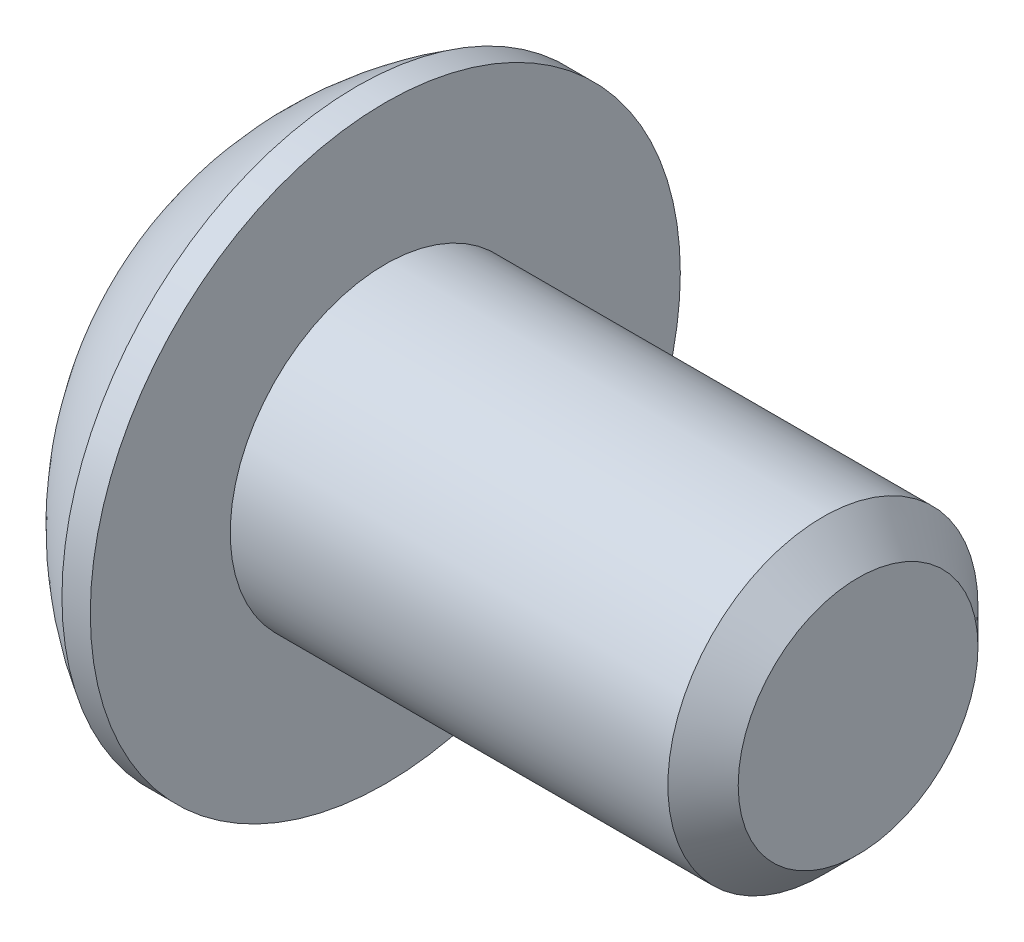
from build123d import *

# Parameters (mm, degrees)
CUT_EXTRUDE1_DEPTH = 1.3208
TAPPED_HOLE1_D     = 2.388
TAPPED_HOLE1_DEPTH = 1.32
TAPPED_HOLE1_TIP   = 0.689356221
CHAMFER1_SIZE      = 0.4724


with BuildPart() as part:
    # Sketch1 → Revolve2 (revolve)
    with BuildSketch(Plane.XY, mode=Mode.PRIVATE) as revolve2_sk:
        with BuildLine():
            Line((4.2799, 0), (-4.2799, 0))
            Line((-4.2799, 0), (-4.2799, 1.9812))
            ThreePointArc((-4.2799, 1.9812), (-3.514453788, 3.109295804), (-2.4511, 3.9624))
            Line((-2.4511, 3.9624), (-2.0701, 3.9624))
            Line((-2.0701, 3.9624), (-2.0701, 2.0828))
            Line((-2.0701, 2.0828), (4.2799, 2.0828))
            Line((4.2799, 2.0828), (4.2799, 0))
        make_face()
    revolve(revolve2_sk.sketch.rotate(Axis((4.2799, 0, 0), (-1, 0, 0)), 90), axis=Axis((4.2799, 0, 0), (-1, 0, 0)))

    # Sketch9 → Cut-Extrude1 (cut)
    with BuildSketch(Plane.ZY.offset(4.2799)):
        Polygon((0, 1.378481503), (1.1938, 0.689240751), (1.1938, -0.689240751), (0, -1.378481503), (-1.1938, -0.689240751), (-1.1938, 0.689240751), align=None)
    extrude(amount=-CUT_EXTRUDE1_DEPTH, mode=Mode.SUBTRACT)

    # Tapped Hole1
    with Locations(Plane(origin=(-4.2799, 0, 0), x_dir=(0, 0, -1), z_dir=(-1, 0, 0))):
        with Locations((0, 0)):
            Hole(TAPPED_HOLE1_D / 2, depth=TAPPED_HOLE1_DEPTH)
            with Locations((0, 0, -(TAPPED_HOLE1_DEPTH + TAPPED_HOLE1_TIP / 2))):  # 120° drill point
                Cone(0, TAPPED_HOLE1_D / 2, TAPPED_HOLE1_TIP, mode=Mode.SUBTRACT)

    # Chamfer1
    chamfer1_edges = [part.edges().sort_by_distance(p)[0] for p in [
        (4.2799, 0, 2.0828),
    ]]
    chamfer(chamfer1_edges, length=CHAMFER1_SIZE)


solid = part.part
